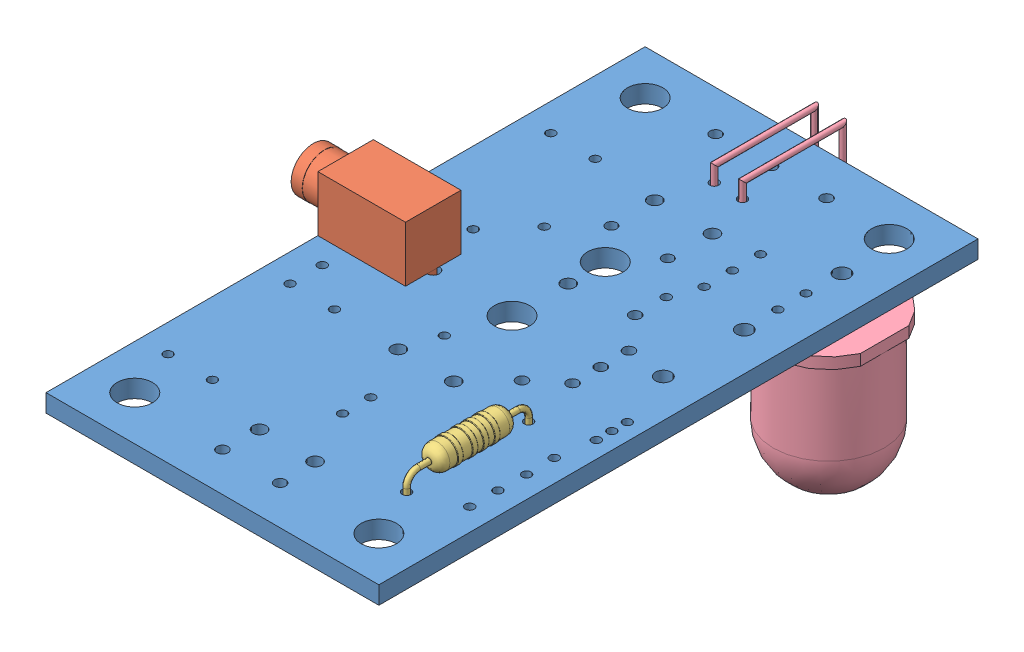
SolidWorks assembly Module DEL10 APOR2BAT.SLDASM, configuration Défaut (file format 7000). Lengths in mm.
Overall size (32.91 32.1 61.04).
5 component instances, 4 part files, 6 mates.
Components (placement in the parent):
- CI-AP-MLBP avec jack-1: CI-AP-MLBP avec jack.SLDASM [Défaut] at (1.8858 -1.7142 0) size (32.91 8.01 54)
  - CI BP et DEL-1: CI BP et DEL.SLDPRT [Défaut] at (-14.8869 -1.2382 0) size (30 1.6 54)
  - Embase jack 2.5-1: Embase jack 2.5.SLDPRT [Défaut] at (-14.8868 0.3618 -27.0002) size (10.81 8.01 5)
- Résistance 220 ohm pas 11-1: Résistance 220 ohm pas 11.SLDPRT [Défaut] at (10.9994 0.0475 -13.9996) x (0 0 -1) z (1 0 0) size (11.5 4.15 2.3)
- DEL D10 Pliee-1: DEL D10 Pliee.SLDPRT [Défaut] at (2.0002 -28.4525 -55.5398) x (1 0 0) z (0 1 0) size (10.55 14.79 28.75)
Mates (geometry in assembly coordinates):
- Coïncidente1: coincident aligned: axis of CI-AP-MLBP avec jack-1/CI BP et DEL-1 through (10.9994 -1.3525 -19.4996) axis (0 -1 0); axis of Résistance 220 ohm pas 11-1 through (10.9994 -0.9525 -19.4996) axis (0 -1 0)
- Coïncidente2: coincident aligned: axis of CI-AP-MLBP avec jack-1/CI BP et DEL-1 through (10.9994 -1.3525 -8.4988) axis (0 -1 0); axis of Résistance 220 ohm pas 11-1 through (10.9994 -0.9525 -8.4996) axis (0 -1 0)
- Coïncidente6: coincident aligned: plane of CI-AP-MLBP avec jack-1/CI BP et DEL-1 through (-13.0011 -2.9525 -54) normal (0 -1 0); plane of Résistance 220 ohm pas 11-1 through (10.9994 -2.9525 -8.4996) normal (0 -1 0)
- Coïncidente9: coincident aligned: axis of CI-AP-MLBP avec jack-1/CI BP et DEL-1 through (0.7302 -1.3525 -46.4998) axis (0 -1 0); axis of DEL D10 Pliee-1 through (0.7302 -0.2025 -46.4998) axis (0 -1 0)
- Coïncidente10: coincident aligned: axis of CI-AP-MLBP avec jack-1/CI BP et DEL-1 through (3.2702 -1.3525 -46.4998) axis (0 -1 0); axis of DEL D10 Pliee-1 through (3.2702 -0.2025 -46.4998) axis (0 -1 0)
- Coïncidente11: coincident aligned: plane of CI-AP-MLBP avec jack-1/CI BP et DEL-1 through (-13.0011 -2.9525 -54) normal (0 -1 0); plane of DEL D10 Pliee-1 through (0.7302 -2.9525 -46.4998) normal (0 -1 0)
